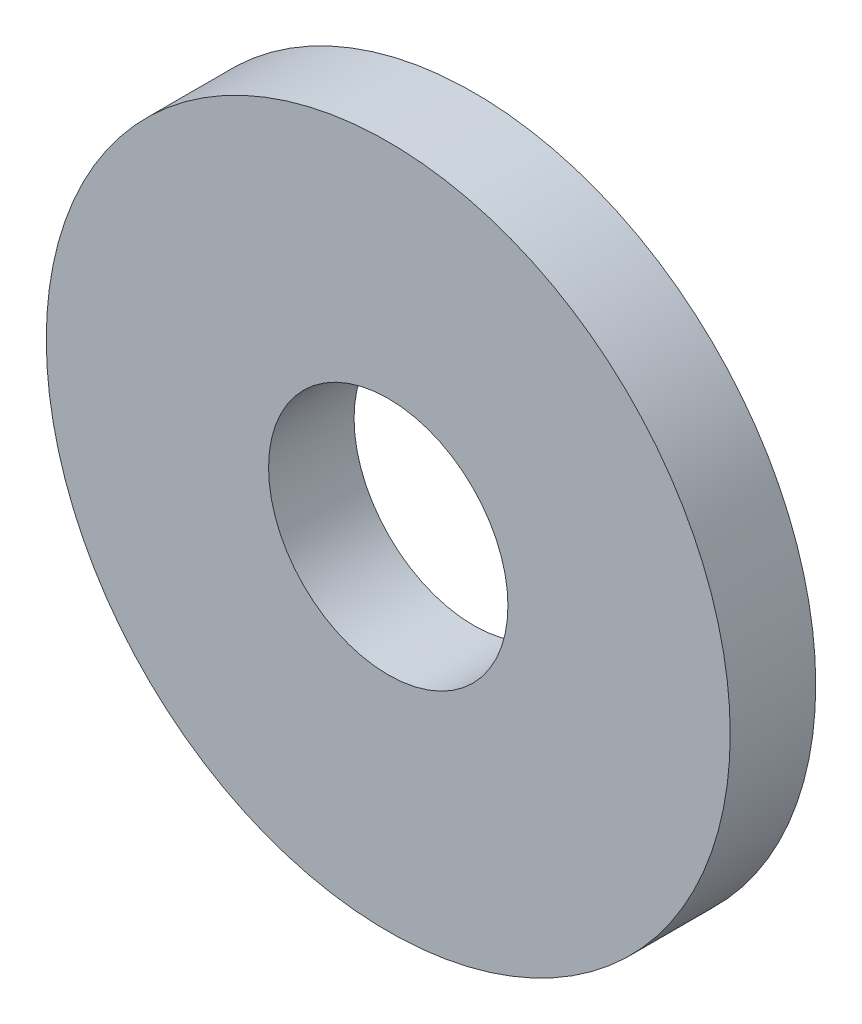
ISO-10303-21;
HEADER;
FILE_DESCRIPTION(('STEP AP214'),'2;1');
FILE_NAME('part.step','',(''),(''),'','','');
FILE_SCHEMA(('AUTOMOTIVE_DESIGN { 1 0 10303 214 1 1 1 1 }'));
ENDSEC;
DATA;
#1=APPLICATION_CONTEXT('core data for automotive mechanical design processes');
#2=APPLICATION_PROTOCOL_DEFINITION('international standard','automotive_design',2000,#1);
#3=PRODUCT_CONTEXT('',#1,'mechanical');
#4=PRODUCT('Part','Part','',(#3));
#5=PRODUCT_RELATED_PRODUCT_CATEGORY('part','',(#4));
#6=PRODUCT_DEFINITION_FORMATION('','',#4);
#7=PRODUCT_DEFINITION_CONTEXT('part definition',#1,'design');
#8=PRODUCT_DEFINITION('design','',#6,#7);
#9=PRODUCT_DEFINITION_SHAPE('','',#8);
#10=(LENGTH_UNIT() NAMED_UNIT(*) SI_UNIT(.MILLI.,.METRE.));
#11=(NAMED_UNIT(*) PLANE_ANGLE_UNIT() SI_UNIT($,.RADIAN.));
#12=(NAMED_UNIT(*) SI_UNIT($,.STERADIAN.) SOLID_ANGLE_UNIT());
#13=UNCERTAINTY_MEASURE_WITH_UNIT(LENGTH_MEASURE(1.E-05),#10,'distance_accuracy_value','');
#14=(GEOMETRIC_REPRESENTATION_CONTEXT(3) GLOBAL_UNCERTAINTY_ASSIGNED_CONTEXT((#13)) GLOBAL_UNIT_ASSIGNED_CONTEXT((#10,
#11,#12)) REPRESENTATION_CONTEXT('',''));
#15=CARTESIAN_POINT('',(0.,0.,0.));
#16=DIRECTION('',(0.,0.,1.));
#17=DIRECTION('',(1.,0.,0.));
#18=AXIS2_PLACEMENT_3D('',#15,#16,#17);
#19=CARTESIAN_POINT('',(0.,0.,5.));
#20=DIRECTION('',(0.,0.,1.));
#21=DIRECTION('',(1.,0.,0.));
#22=AXIS2_PLACEMENT_3D('',#19,#20,#21);
#23=PLANE('',#22);
#24=CARTESIAN_POINT('',(0.,0.,5.));
#25=DIRECTION('',(0.,0.,1.));
#26=DIRECTION('',(1.,0.,0.));
#27=AXIS2_PLACEMENT_3D('',#24,#25,#26);
#28=CIRCLE('',#27,20.);
#29=CARTESIAN_POINT('',(20.,0.,5.));
#30=VERTEX_POINT('',#29);
#31=EDGE_CURVE('E10',#30,#30,#28,.T.);
#32=ORIENTED_EDGE('',*,*,#31,.T.);
#33=EDGE_LOOP('',(#32));
#34=FACE_BOUND('',#33,.T.);
#35=CARTESIAN_POINT('',(0.,0.,5.));
#36=DIRECTION('',(0.,0.,1.));
#37=DIRECTION('',(1.,0.,0.));
#38=AXIS2_PLACEMENT_3D('',#35,#36,#37);
#39=CIRCLE('',#38,7.);
#40=CARTESIAN_POINT('',(7.,0.,5.));
#41=VERTEX_POINT('',#40);
#42=EDGE_CURVE('E35',#41,#41,#39,.T.);
#43=ORIENTED_EDGE('',*,*,#42,.F.);
#44=EDGE_LOOP('',(#43));
#45=FACE_BOUND('',#44,.T.);
#46=ADVANCED_FACE('F24',(#34,#45),#23,.T.);
#47=CARTESIAN_POINT('',(0.,0.,0.));
#48=DIRECTION('',(0.,0.,1.));
#49=DIRECTION('',(1.,0.,0.));
#50=AXIS2_PLACEMENT_3D('',#47,#48,#49);
#51=PLANE('',#50);
#52=CARTESIAN_POINT('',(0.,0.,0.));
#53=DIRECTION('',(0.,0.,1.));
#54=DIRECTION('',(1.,0.,0.));
#55=AXIS2_PLACEMENT_3D('',#52,#53,#54);
#56=CIRCLE('',#55,20.);
#57=CARTESIAN_POINT('',(20.,0.,0.));
#58=VERTEX_POINT('',#57);
#59=EDGE_CURVE('E31',#58,#58,#56,.T.);
#60=ORIENTED_EDGE('',*,*,#59,.F.);
#61=EDGE_LOOP('',(#60));
#62=FACE_BOUND('',#61,.T.);
#63=CARTESIAN_POINT('',(0.,0.,0.));
#64=DIRECTION('',(0.,0.,1.));
#65=DIRECTION('',(1.,0.,0.));
#66=AXIS2_PLACEMENT_3D('',#63,#64,#65);
#67=CIRCLE('',#66,7.);
#68=CARTESIAN_POINT('',(7.,0.,0.));
#69=VERTEX_POINT('',#68);
#70=EDGE_CURVE('E39',#69,#69,#67,.T.);
#71=ORIENTED_EDGE('',*,*,#70,.T.);
#72=EDGE_LOOP('',(#71));
#73=FACE_BOUND('',#72,.T.);
#74=ADVANCED_FACE('F45',(#62,#73),#51,.F.);
#75=CARTESIAN_POINT('',(0.,0.,5.));
#76=DIRECTION('',(0.,0.,-1.));
#77=DIRECTION('',(-1.,0.,0.));
#78=AXIS2_PLACEMENT_3D('',#75,#76,#77);
#79=CYLINDRICAL_SURFACE('',#78,20.);
#80=ORIENTED_EDGE('',*,*,#31,.F.);
#81=EDGE_LOOP('',(#80));
#82=FACE_BOUND('',#81,.T.);
#83=ORIENTED_EDGE('',*,*,#59,.T.);
#84=EDGE_LOOP('',(#83));
#85=FACE_BOUND('',#84,.T.);
#86=ADVANCED_FACE('F26',(#82,#85),#79,.T.);
#87=CARTESIAN_POINT('',(0.,0.,5.001));
#88=DIRECTION('',(0.,0.,-1.));
#89=DIRECTION('',(-1.,0.,0.));
#90=AXIS2_PLACEMENT_3D('',#87,#88,#89);
#91=CYLINDRICAL_SURFACE('',#90,7.);
#92=ORIENTED_EDGE('',*,*,#42,.T.);
#93=EDGE_LOOP('',(#92));
#94=FACE_BOUND('',#93,.T.);
#95=ORIENTED_EDGE('',*,*,#70,.F.);
#96=EDGE_LOOP('',(#95));
#97=FACE_BOUND('',#96,.T.);
#98=ADVANCED_FACE('F47',(#94,#97),#91,.F.);
#99=CLOSED_SHELL('',(#46,#74,#86,#98));
#100=MANIFOLD_SOLID_BREP('B2',#99);
#101=ADVANCED_BREP_SHAPE_REPRESENTATION('',(#18,#100),#14);
#102=SHAPE_DEFINITION_REPRESENTATION(#9,#101);
ENDSEC;
END-ISO-10303-21;
